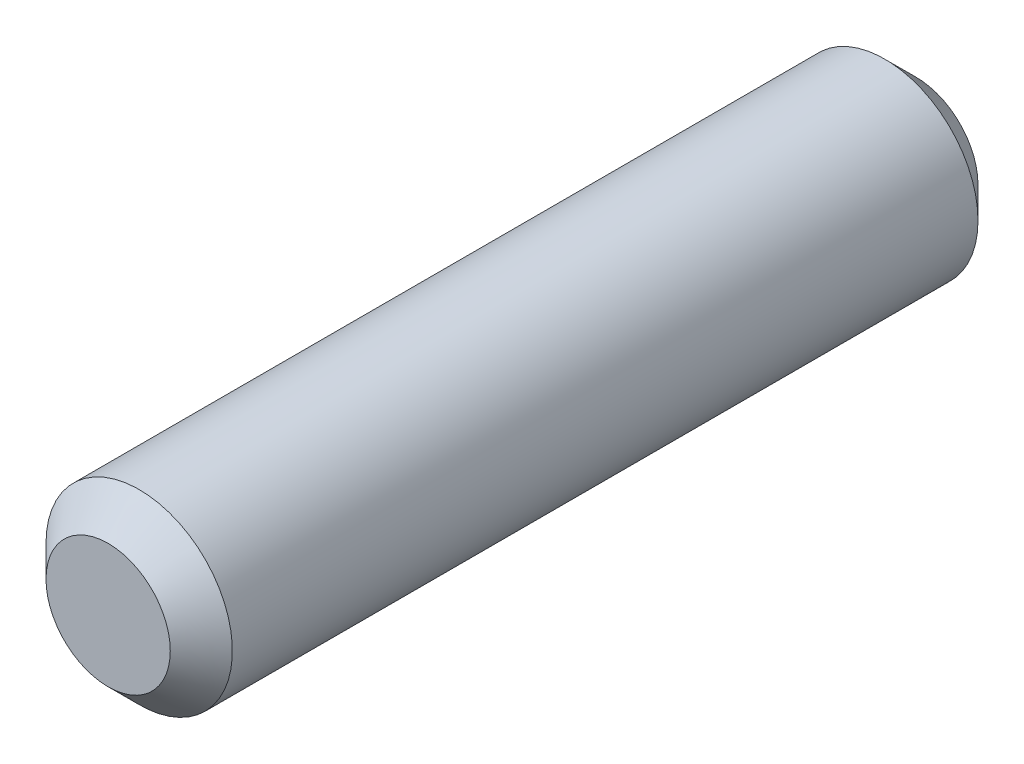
from build123d import *

# Parameters (mm, degrees)
ESQUISSE1_R            = 1.5
CYLINDRE_DE_BASE_DEPTH = 6.5
CHANFREIN1_SIZE        = 0.5


with BuildPart() as part:
    # Esquisse1 → Cylindre de base (new, symmetric)
    with BuildSketch(Plane.XY):
        with Locations(Location((0, 0, 0), (0, 0, 180))):
            Circle(ESQUISSE1_R)
    extrude(amount=CYLINDRE_DE_BASE_DEPTH, both=True)

    # Chanfrein1
    chanfrein1_edges = [part.edges().sort_by_distance(p)[0] for p in [
        (1.5, 0, -6.5),
        (1.5, 0, 6.5),
    ]]
    chamfer(chanfrein1_edges, length=CHANFREIN1_SIZE)


solid = part.part
